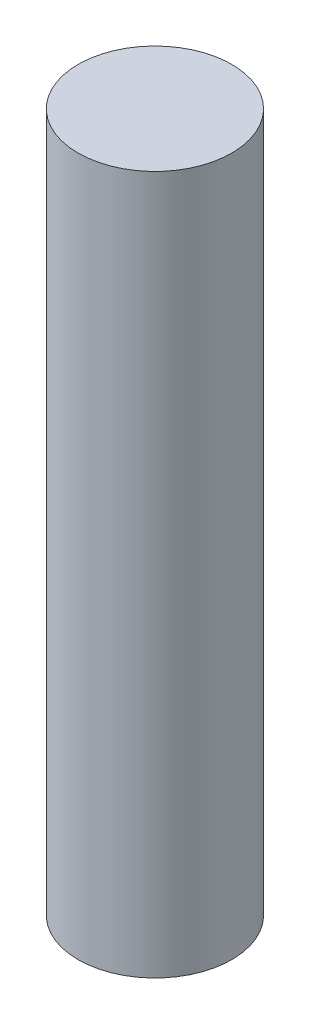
ISO-10303-21;
HEADER;
FILE_DESCRIPTION(('STEP AP214'),'2;1');
FILE_NAME('part.step','',(''),(''),'','','');
FILE_SCHEMA(('AUTOMOTIVE_DESIGN { 1 0 10303 214 1 1 1 1 }'));
ENDSEC;
DATA;
#1=APPLICATION_CONTEXT('core data for automotive mechanical design processes');
#2=APPLICATION_PROTOCOL_DEFINITION('international standard','automotive_design',2000,#1);
#3=PRODUCT_CONTEXT('',#1,'mechanical');
#4=PRODUCT('Part','Part','',(#3));
#5=PRODUCT_RELATED_PRODUCT_CATEGORY('part','',(#4));
#6=PRODUCT_DEFINITION_FORMATION('','',#4);
#7=PRODUCT_DEFINITION_CONTEXT('part definition',#1,'design');
#8=PRODUCT_DEFINITION('design','',#6,#7);
#9=PRODUCT_DEFINITION_SHAPE('','',#8);
#10=(LENGTH_UNIT() NAMED_UNIT(*) SI_UNIT(.MILLI.,.METRE.));
#11=(NAMED_UNIT(*) PLANE_ANGLE_UNIT() SI_UNIT($,.RADIAN.));
#12=(NAMED_UNIT(*) SI_UNIT($,.STERADIAN.) SOLID_ANGLE_UNIT());
#13=UNCERTAINTY_MEASURE_WITH_UNIT(LENGTH_MEASURE(1.E-05),#10,'distance_accuracy_value','');
#14=(GEOMETRIC_REPRESENTATION_CONTEXT(3) GLOBAL_UNCERTAINTY_ASSIGNED_CONTEXT((#13)) GLOBAL_UNIT_ASSIGNED_CONTEXT((#10,
#11,#12)) REPRESENTATION_CONTEXT('',''));
#15=CARTESIAN_POINT('',(0.,0.,0.));
#16=DIRECTION('',(0.,0.,1.));
#17=DIRECTION('',(1.,0.,0.));
#18=AXIS2_PLACEMENT_3D('',#15,#16,#17);
#19=CARTESIAN_POINT('',(0.,1000.,0.));
#20=DIRECTION('',(0.,-1.,0.));
#21=DIRECTION('',(0.,0.,-1.));
#22=AXIS2_PLACEMENT_3D('',#19,#20,#21);
#23=CYLINDRICAL_SURFACE('',#22,110.);
#24=CARTESIAN_POINT('',(0.,1000.,0.));
#25=DIRECTION('',(0.,1.,0.));
#26=DIRECTION('',(0.,0.,1.));
#27=AXIS2_PLACEMENT_3D('',#24,#25,#26);
#28=CIRCLE('',#27,110.);
#29=CARTESIAN_POINT('',(0.,1000.,110.));
#30=VERTEX_POINT('',#29);
#31=EDGE_CURVE('E10',#30,#30,#28,.T.);
#32=ORIENTED_EDGE('',*,*,#31,.F.);
#33=EDGE_LOOP('',(#32));
#34=FACE_BOUND('',#33,.T.);
#35=CARTESIAN_POINT('',(0.,0.,0.));
#36=DIRECTION('',(0.,1.,0.));
#37=DIRECTION('',(0.,0.,1.));
#38=AXIS2_PLACEMENT_3D('',#35,#36,#37);
#39=CIRCLE('',#38,110.);
#40=CARTESIAN_POINT('',(0.,0.,110.));
#41=VERTEX_POINT('',#40);
#42=EDGE_CURVE('E33',#41,#41,#39,.T.);
#43=ORIENTED_EDGE('',*,*,#42,.T.);
#44=EDGE_LOOP('',(#43));
#45=FACE_BOUND('',#44,.T.);
#46=ADVANCED_FACE('F30',(#34,#45),#23,.T.);
#47=CARTESIAN_POINT('',(0.,1000.,0.));
#48=DIRECTION('',(0.,1.,0.));
#49=DIRECTION('',(0.,0.,1.));
#50=AXIS2_PLACEMENT_3D('',#47,#48,#49);
#51=PLANE('',#50);
#52=ORIENTED_EDGE('',*,*,#31,.T.);
#53=EDGE_LOOP('',(#52));
#54=FACE_BOUND('',#53,.T.);
#55=ADVANCED_FACE('F45',(#54),#51,.T.);
#56=CARTESIAN_POINT('',(0.,0.,0.));
#57=DIRECTION('',(0.,1.,0.));
#58=DIRECTION('',(0.,0.,1.));
#59=AXIS2_PLACEMENT_3D('',#56,#57,#58);
#60=PLANE('',#59);
#61=ORIENTED_EDGE('',*,*,#42,.F.);
#62=EDGE_LOOP('',(#61));
#63=FACE_BOUND('',#62,.T.);
#64=ADVANCED_FACE('F43',(#63),#60,.F.);
#65=CLOSED_SHELL('',(#46,#55,#64));
#66=MANIFOLD_SOLID_BREP('B2',#65);
#67=ADVANCED_BREP_SHAPE_REPRESENTATION('',(#18,#66),#14);
#68=SHAPE_DEFINITION_REPRESENTATION(#9,#67);
ENDSEC;
END-ISO-10303-21;
